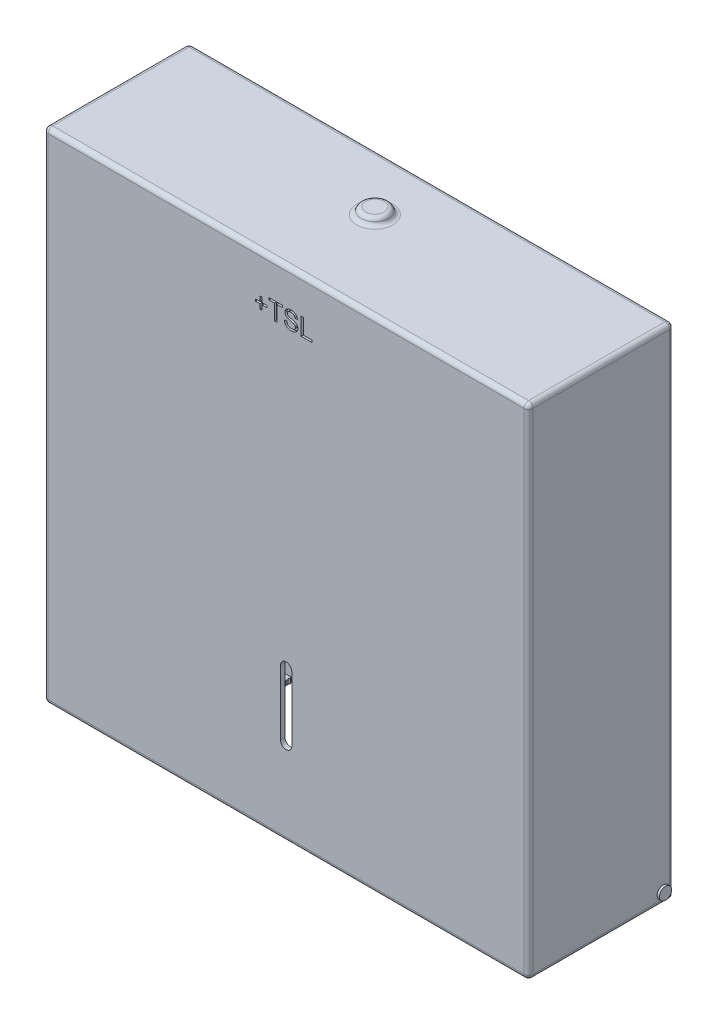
from build123d import *

# Parameters (mm, degrees)
SKETCH2_W              = 271.9832
SKETCH2_H              = 279.9842
BOSS_EXTRUDE1_DEPTH    = 81.56053127
SHELL2_T               = 2.54
FILLET1_R              = 2.54
CUT_EXTRUDE1_DEPTH     = 1.27
CUT_EXTRUDE4_DEPTH     = 13.97
SKETCH6_R              = 7.747
BOSS_EXTRUDE2_DEPTH    = 3.81
FILLET2_R              = 2.54
FILLET3_R              = 2.54
SKETCH7_R              = 3.429
SKETCH7_R_2            = 1.7145
CUT_EXTRUDE6_DEPTH     = 3.81
SKETCH8_W              = 152.6032
SKETCH8_H              = 76.48053127
CUT_EXTRUDE7_DEPTH     = 3.81
SKETCH9_R              = 3.429
BOSS_EXTRUDE3_DEPTH    = 1.27
LPATTERN3_COUNT        = 2
LPATTERN3_PITCH        = 273.05
BOSS_EXTRUDE4_DEPTH    = 2.54
LPATTERN4_COUNT        = 60
LPATTERN4_PITCH        = 1.27
BOSS_EXTRUDE5_DEPTH    = 2.54
LPATTERN5_COUNT        = 60
LPATTERN5_PITCH        = 1.27
CUT_EXTRUDE8_DEPTH     = 2.54
LPATTERN6_COUNT        = 2
LPATTERN6_PITCH        = 199.9996
LPATTERN7_COUNT        = 2
LPATTERN7_PITCH        = 199.9996
LPATTERN7_COPY_1_DEPTH = 2.54


with BuildPart() as part:
    # Sketch2 → Boss-Extrude1 (new body)
    with BuildSketch(Plane.XY):
        Rectangle(SKETCH2_W, SKETCH2_H)
    extrude(amount=-BOSS_EXTRUDE1_DEPTH)

    # Shell2 (no face opened: a closed hollow body)
    add(offset(amount=-SHELL2_T, mode=Mode.PRIVATE), mode=Mode.SUBTRACT)

    # Fillet1
    fillet1_edges = [part.edges().sort_by_distance(p)[0] for p in [
        (-135.9916, 0, -81.56053127),
        (0, -139.9921, -81.56053127),
        (135.9916, 0, -81.56053127),
        (0, -139.9921, 0),
        (-135.9916, 0, 0),
        (0, 139.9921, 0),
        (135.9916, 0, 0),
        (135.9916, -139.9921, -40.780265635),
        (-135.9916, -139.9921, -40.780265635),
        (-135.9916, 139.9921, -40.780265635),
        (135.9916, 139.9921, -40.780265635),
        (0, 139.9921, -81.56053127),
    ]]
    fillet(fillet1_edges, radius=FILLET1_R)

    # Sketch3 → Cut-Extrude1 (cut)
    with BuildSketch(Plane.XY):
        Polygon((-14.547920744, 111.621301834), (-14.547920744, 114.248889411), (-17.175508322, 114.248889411), (-17.175508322, 115.374998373), (-14.547920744, 115.374998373), (-14.547920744, 118.002585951), (-13.421811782, 118.002585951), (-13.421811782, 115.374998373), (-10.794224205, 115.374998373), (-10.794224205, 114.248889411), (-13.421811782, 114.248889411), (-13.421811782, 111.621301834), align=None)
        Polygon((-6.540034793, 109.9947), (-6.540034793, 118.628202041), (-9.668115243, 118.628202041), (-9.668115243, 119.754311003), (-2.035598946, 119.754311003), (-2.035598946, 118.628202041), (-5.163679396, 118.628202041), (-5.163679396, 109.9947), align=None)
        with BuildLine():
            Line((-1.034613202, 113.373026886), (0.341742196, 113.373026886))
            add(Edge.make_bspline(
                [(0.341742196, 113.373026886), (0.356881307, 113.249449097), (0.385964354, 113.012049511), (0.467283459, 112.675571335), (0.571946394, 112.373042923), (0.702353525, 112.100449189), (0.873899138, 111.861058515), (1.080582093, 111.645131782), (1.331587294, 111.458152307), (1.614914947, 111.291752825), (1.930462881, 111.161102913), (2.267338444, 111.064249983), (2.623935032, 111.00686385), (2.868110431, 110.999464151), (2.992790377, 110.995685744)],
                knots=[0, 0, 0, 0, 1.125557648, 2.162256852, 3.1243583, 4.018160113, 4.88511607, 5.777380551, 6.711250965, 7.707237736, 8.743031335, 9.791730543, 10.872421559, 12, 12, 12, 12], degree=3))
            add(Edge.make_bspline(
                [(2.992790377, 110.995685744), (3.103121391, 110.997727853), (3.318245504, 111.001709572), (3.629446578, 111.049539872), (3.922287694, 111.117385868), (4.191318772, 111.220013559), (4.435547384, 111.344635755), (4.647632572, 111.495369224), (4.828699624, 111.66535517), (4.970488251, 111.85907093), (5.081874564, 112.062052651), (5.16358794, 112.270696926), (5.212262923, 112.483845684), (5.218465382, 112.627263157), (5.221547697, 112.698534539)],
                knots=[0, 0, 0, 0, 1.267006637, 2.470417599, 3.611360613, 4.716023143, 5.771382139, 6.754486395, 7.697536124, 8.612899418, 9.501261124, 10.352596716, 11.181322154, 12, 12, 12, 12], degree=3))
            add(Edge.make_bspline(
                [(5.221547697, 112.698534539), (5.218252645, 112.769083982), (5.211812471, 112.906972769), (5.169843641, 113.107721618), (5.090075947, 113.291465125), (4.986568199, 113.465702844), (4.842571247, 113.62500549), (4.66064735, 113.771788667), (4.436788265, 113.904863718), (4.269711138, 113.977743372), (4.181460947, 114.016238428)],
                knots=[0, 0, 0, 0, 0.942140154, 1.841411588, 2.718743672, 3.605002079, 4.535543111, 5.568170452, 6.715506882, 8, 8, 8, 8], degree=3))
            add(Edge.make_bspline(
                [(4.181460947, 114.016238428), (4.147077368, 114.030348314), (4.069398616, 114.062225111), (3.936260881, 114.1044245), (3.778276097, 114.158992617), (3.591648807, 114.215188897), (3.377378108, 114.274636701), (3.135820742, 114.341922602), (2.867111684, 114.413477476), (2.578871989, 114.489639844), (2.287837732, 114.567085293), (2.009788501, 114.644603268), (1.753969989, 114.723293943), (1.518286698, 114.799062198), (1.303953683, 114.875143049), (1.110362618, 114.949453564), (0.937272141, 115.020486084), (0.831555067, 115.072715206), (0.781628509, 115.097381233)],
                knots=[0, 0, 0, 0, 0.499201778, 1.127787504, 1.87543728, 2.745208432, 3.745951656, 4.863402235, 6.114490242, 7.482339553, 8.869366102, 10.161191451, 11.360587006, 12.46547846, 13.487450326, 14.41601931, 15.251940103, 16, 16, 16, 16], degree=3))
            add(Edge.make_bspline(
                [(0.781628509, 115.097381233), (0.666761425, 115.159435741), (0.445038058, 115.279217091), (0.146622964, 115.493386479), (-0.104822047, 115.731047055), (-0.308236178, 115.991854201), (-0.467643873, 116.271397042), (-0.575195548, 116.570150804), (-0.648859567, 116.882692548), (-0.655743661, 117.097613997), (-0.659243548, 117.206880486)],
                knots=[0, 0, 0, 0, 1.158441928, 2.236094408, 3.251151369, 4.220012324, 5.163146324, 6.095083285, 7.031536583, 8, 8, 8, 8], degree=3))
            add(Edge.make_bspline(
                [(-0.659243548, 117.206880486), (-0.654598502, 117.327874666), (-0.645359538, 117.568531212), (-0.563404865, 117.921679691), (-0.432685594, 118.261502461), (-0.283887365, 118.531292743), (-0.13877621, 118.735306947), (-0.01847796, 118.882234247), (0.116460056, 119.018048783), (0.261882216, 119.144646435), (0.420388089, 119.260135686), (0.588045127, 119.369263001), (0.77092158, 119.463060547), (1.027890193, 119.582443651), (1.371652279, 119.701658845), (1.804405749, 119.805539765), (2.259864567, 119.866713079), (2.570315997, 119.875133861), (2.728858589, 119.879434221)],
                knots=[0, 0, 0, 0, 1.199927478, 2.386647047, 3.578628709, 4.806592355, 5.433127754, 6.062729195, 6.689531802, 7.331674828, 7.974827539, 8.635320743, 9.315455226, 10.01318112, 11.447700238, 12.918145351, 14.426146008, 16, 16, 16, 16], degree=3))
            add(Edge.make_bspline(
                [(2.728858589, 119.879434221), (2.902393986, 119.875457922), (3.240300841, 119.867715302), (3.731289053, 119.803298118), (4.189246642, 119.692676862), (4.548392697, 119.568847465), (4.813905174, 119.443487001), (5.002532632, 119.345669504), (5.177616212, 119.232574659), (5.340732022, 119.110188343), (5.493395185, 118.97856645), (5.631681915, 118.834578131), (5.761597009, 118.683136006), (5.914265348, 118.465712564), (6.078874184, 118.177953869), (6.221200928, 117.805151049), (6.318981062, 117.411688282), (6.338001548, 117.139677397), (6.347656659, 117.001600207)],
                knots=[0, 0, 0, 0, 1.607600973, 3.130308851, 4.577334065, 5.967726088, 6.640410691, 7.296826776, 7.935019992, 8.569057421, 9.185393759, 9.8003086, 10.417295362, 11.032210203, 12.259799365, 13.477607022, 14.719591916, 16, 16, 16, 16], degree=3))
            Line((6.347656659, 117.001600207), (4.971301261, 117.001600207))
            add(Edge.make_bspline(
                [(4.971301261, 117.001600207), (4.962556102, 117.07148511), (4.945444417, 117.208229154), (4.902992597, 117.40618673), (4.84348369, 117.590040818), (4.773780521, 117.761505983), (4.689285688, 117.918798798), (4.590789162, 118.063429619), (4.477091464, 118.193694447), (4.351118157, 118.313035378), (4.209035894, 118.416948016), (4.05157474, 118.507147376), (3.878468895, 118.583345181), (3.689870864, 118.645753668), (3.485743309, 118.694142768), (3.26562194, 118.729738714), (3.029591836, 118.747968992), (2.867041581, 118.751508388), (2.783599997, 118.753325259)],
                knots=[0, 0, 0, 0, 1.074487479, 2.102453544, 3.083708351, 4.020042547, 4.923259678, 5.803182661, 6.684453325, 7.556870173, 8.445961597, 9.363679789, 10.320905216, 11.327237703, 12.390948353, 13.519046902, 14.726457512, 16, 16, 16, 16], degree=3))
            add(Edge.make_bspline(
                [(2.783599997, 118.753325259), (2.696866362, 118.752671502), (2.528971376, 118.751405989), (2.286260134, 118.728337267), (2.061298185, 118.696686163), (1.854471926, 118.649998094), (1.666458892, 118.588883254), (1.494468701, 118.518309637), (1.34331468, 118.428874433), (1.209473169, 118.329255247), (1.094017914, 118.219032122), (0.994512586, 118.102883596), (0.90650781, 117.984222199), (0.838126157, 117.856561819), (0.782453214, 117.72473715), (0.746538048, 117.58627032), (0.721109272, 117.443722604), (0.718462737, 117.34645944), (0.71711185, 117.296812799)],
                knots=[0, 0, 0, 0, 1.464176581, 2.834285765, 4.113735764, 5.29917439, 6.409476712, 7.449999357, 8.431575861, 9.367089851, 10.262376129, 11.120706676, 11.948504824, 12.751342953, 13.560717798, 14.359016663, 15.162382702, 16, 16, 16, 16], degree=3))
            add(Edge.make_bspline(
                [(0.71711185, 117.296812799), (0.720668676, 117.212845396), (0.727572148, 117.049872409), (0.79806669, 116.81833692), (0.906487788, 116.60727732), (1.013299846, 116.49244087), (1.06706585, 116.434635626)],
                knots=[0, 0, 0, 0, 1.050964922, 2.039826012, 3.013306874, 4, 4, 4, 4], degree=3))
            add(Edge.make_bspline(
                [(1.06706585, 116.434635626), (1.100959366, 116.40574733), (1.175912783, 116.341862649), (1.31537517, 116.257318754), (1.488287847, 116.171897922), (1.695806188, 116.086983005), (1.93757315, 116.001543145), (2.213198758, 115.913572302), (2.523732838, 115.826200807), (2.859711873, 115.742003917), (3.19912904, 115.657468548), (3.521689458, 115.573255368), (3.817854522, 115.493444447), (4.087154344, 115.415601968), (4.329867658, 115.33994804), (4.545150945, 115.264897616), (4.734745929, 115.195870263), (4.850895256, 115.147303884), (4.904829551, 115.124751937)],
                knots=[0, 0, 0, 0, 0.523891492, 1.158553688, 1.913783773, 2.794766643, 3.797521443, 4.933638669, 6.202080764, 7.596537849, 9.013317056, 10.322179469, 11.523240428, 12.626146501, 13.623953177, 14.517289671, 15.311498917, 16, 16, 16, 16], degree=3))
            add(Edge.make_bspline(
                [(4.904829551, 115.124751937), (4.975000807, 115.092398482), (5.112735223, 115.028894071), (5.307854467, 114.920469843), (5.48992189, 114.807877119), (5.65746651, 114.688084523), (5.809946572, 114.560840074), (5.949066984, 114.427601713), (6.075667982, 114.289118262), (6.184641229, 114.140957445), (6.282488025, 113.989108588), (6.368110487, 113.831449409), (6.437052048, 113.667052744), (6.497518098, 113.497900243), (6.541010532, 113.322110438), (6.575117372, 113.141458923), (6.595011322, 112.955096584), (6.596930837, 112.828917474), (6.597903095, 112.765006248)],
                knots=[0, 0, 0, 0, 1.198900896, 2.353241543, 3.461831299, 4.520043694, 5.547003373, 6.541368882, 7.508191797, 8.454912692, 9.392021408, 10.310662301, 11.235020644, 12.156274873, 13.095836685, 14.042125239, 15.00831306, 16, 16, 16, 16], degree=3))
            add(Edge.make_bspline(
                [(6.597903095, 112.765006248), (6.592809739, 112.637456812), (6.582697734, 112.384228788), (6.495629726, 112.01095897), (6.35885049, 111.649262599), (6.198442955, 111.362236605), (6.046809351, 111.142990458), (5.919429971, 110.985406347), (5.778173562, 110.839695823), (5.626517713, 110.701294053), (5.463284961, 110.573024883), (5.28709915, 110.454844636), (5.09981984, 110.345523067), (4.832389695, 110.212308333), (4.477198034, 110.072953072), (4.024755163, 109.95690273), (3.547935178, 109.881618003), (3.220521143, 109.873645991), (3.053396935, 109.869576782)],
                knots=[0, 0, 0, 0, 1.197055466, 2.376552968, 3.581957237, 4.820753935, 5.454298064, 6.085440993, 6.72202542, 7.359198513, 8.013298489, 8.67051481, 9.351020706, 10.049282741, 11.476266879, 12.925760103, 14.430794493, 16, 16, 16, 16], degree=3))
            add(Edge.make_bspline(
                [(3.053396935, 109.869576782), (2.947135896, 109.870453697), (2.738985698, 109.872171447), (2.433132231, 109.892973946), (2.140027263, 109.923065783), (1.859958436, 109.967887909), (1.593804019, 110.026692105), (1.340608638, 110.09730458), (1.099772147, 110.178629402), (0.872136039, 110.274265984), (0.658294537, 110.385385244), (0.454402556, 110.505254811), (0.263792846, 110.641132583), (0.08606415, 110.790883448), (-0.083286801, 110.950181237), (-0.237240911, 111.125531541), (-0.381032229, 111.311806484), (-0.511375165, 111.510710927), (-0.627816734, 111.719642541), (-0.732530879, 111.935092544), (-0.820754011, 112.158623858), (-0.891853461, 112.38910676), (-0.952078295, 112.624998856), (-0.993842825, 112.868268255), (-1.024549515, 113.118151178), (-1.031238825, 113.287566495), (-1.034613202, 113.373026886)],
                knots=[0, 0, 0, 0, 1.259822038, 2.467811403, 3.633536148, 4.752793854, 5.829021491, 6.863980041, 7.868367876, 8.841470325, 9.788447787, 10.724101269, 11.643985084, 12.560193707, 13.478453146, 14.398077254, 15.323914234, 16.266973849, 17.21495974, 18.158525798, 19.105629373, 20.061269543, 21.017128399, 21.990322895, 22.986232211, 24, 24, 24, 24], degree=3))
        make_face()
        Polygon((8.474751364, 109.9947), (8.474751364, 119.754311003), (9.851106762, 119.754311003), (9.851106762, 111.120808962), (14.480665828, 111.120808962), (14.480665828, 109.9947), align=None)
    extrude(amount=-CUT_EXTRUDE1_DEPTH, mode=Mode.SUBTRACT)

    # Sketch4 → Cut-Extrude4 (cut)
    with BuildSketch(Plane.XY):
        with BuildLine():
            Line((-3.175, -91.997793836), (-3.175, -55.481816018))
            ThreePointArc((-3.175, -55.481816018), (0, -52.4383), (3.175, -55.481816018))
            Line((3.175, -55.481816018), (3.175, -91.997793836))
            ThreePointArc((3.175, -91.997793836), (0, -95.0341), (-3.175, -91.997793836))
        make_face()
    extrude(amount=-CUT_EXTRUDE4_DEPTH, mode=Mode.SUBTRACT)

    # Sketch6 → Boss-Extrude2 (add)
    with BuildSketch(Plane(origin=(0, 139.9921, 0), x_dir=(1, 0, 0), z_dir=(0, 1, 0))):
        with Locations(Location((0, 49.81053127, 0), (0, 0, 90))):
            Circle(SKETCH6_R)
    extrude(amount=BOSS_EXTRUDE2_DEPTH)

    # Fillet2
    fillet2_edges = [part.edges().sort_by_distance(p)[0] for p in [
        (0, 143.8021, -42.06353127),
    ]]
    fillet(fillet2_edges, radius=FILLET2_R)

    # Fillet3
    fillet3_edges = [part.edges().sort_by_distance(p)[0] for p in [
        (0, 139.9921, -42.06353127),
    ]]
    fillet(fillet3_edges, radius=FILLET3_R)

    # Sketch7 → Cut-Extrude6 (cut)
    with BuildSketch(Plane(origin=(0, 0, -81.56053127), x_dir=(-1, 0, 0), z_dir=(0, 0, -1))):
        with Locations((0, -57.4421)):
            Circle(SKETCH7_R)
        with Locations((0, -32.0421)):
            Circle(SKETCH7_R_2)
        with Locations((0, -6.6421)):
            Circle(SKETCH7_R_2)
        with Locations((0, 18.7579)):
            Circle(SKETCH7_R)
    extrude(amount=-CUT_EXTRUDE6_DEPTH, mode=Mode.SUBTRACT)

    # Sketch8 → Cut-Extrude7 (cut)
    with BuildSketch(Plane.XZ.offset(139.9921)):
        with Locations((0, -40.780265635)):
            Rectangle(SKETCH8_W, SKETCH8_H)
    extrude(amount=-CUT_EXTRUDE7_DEPTH, mode=Mode.SUBTRACT)

    # Sketch9 → Boss-Extrude3 (add)
    with BuildSketch(Plane(origin=(135.9916, 0, 0), x_dir=(0, 0, -1), z_dir=(1, 0, 0))):
        with Locations((75.59153127, -134.0231)):
            Circle(SKETCH9_R)
    boss_extrude3 = extrude(amount=BOSS_EXTRUDE3_DEPTH)

    # LPattern3: Boss-Extrude3 ×2
    with Locations(*[(-i * LPATTERN3_PITCH, 0, 0) for i in range(1, LPATTERN3_COUNT)]):
        add(boss_extrude3)

    # Sketch12 → Boss-Extrude4 (add)
    with BuildSketch(Plane.XZ.offset(139.9921)):
        Polygon((-76.3016, -2.54), (-76.3016, -3.74016019), (-75.743411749, -3.140080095), align=None)
    boss_extrude4 = extrude(amount=-BOSS_EXTRUDE4_DEPTH)

    # LPattern4: Boss-Extrude4 ×60
    with Locations(*[(0, 0, -i * LPATTERN4_PITCH) for i in range(1, LPATTERN4_COUNT)]):
        add(boss_extrude4)

    # Sketch13 → Boss-Extrude5 (add)
    with BuildSketch(Plane.XZ.offset(139.9921)):
        Polygon((76.3016, -2.54), (76.3016, -3.751726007), (75.866001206, -3.145863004), align=None)
    boss_extrude5 = extrude(amount=-BOSS_EXTRUDE5_DEPTH)

    # LPattern5: Boss-Extrude5 ×60
    with Locations(*[(0, 0, -i * LPATTERN5_PITCH) for i in range(1, LPATTERN5_COUNT)]):
        add(boss_extrude5)

    # Sketch14 → Cut-Extrude8 (cut)
    with BuildSketch(Plane(origin=(0, 0, -81.56053127), x_dir=(-1, 0, 0), z_dir=(0, 0, -1))):
        with BuildLine():
            Line((-103.2256, -105.028838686), (-103.2256, -98.982390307))
            ThreePointArc((-103.2256, -98.982390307), (-100.0506, -95.807390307), (-96.8756, -98.982390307))
            Line((-96.8756, -98.982390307), (-96.8756, -105.028838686))
            ThreePointArc((-96.8756, -105.028838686), (-100.0506, -116.8781), (-103.2256, -105.028838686))
        make_face()
    cut_extrude8 = extrude(amount=-CUT_EXTRUDE8_DEPTH, mode=Mode.SUBTRACT)

    # LPattern6: Cut-Extrude8 ×2
    with Locations(*[(-i * LPATTERN6_PITCH, 0, 0) for i in range(1, LPATTERN6_COUNT)]):
        add(cut_extrude8, mode=Mode.SUBTRACT)

    # LPattern7: Cut-Extrude8 ×2
    with Locations(*[(0, i * LPATTERN7_PITCH, 0) for i in range(1, LPATTERN7_COUNT)]):
        add(cut_extrude8, mode=Mode.SUBTRACT)

    # LPattern7 copy 1 sketch → LPattern7 copy 1 (cut)
    with BuildSketch(Plane(origin=(-199.9996, 199.9996, -81.56053127), x_dir=(-1, 0, 0), z_dir=(0, 0, -1))):
        with BuildLine():
            Line((-103.2256, -105.028838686), (-103.2256, -98.982390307))
            ThreePointArc((-103.2256, -98.982390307), (-100.0506, -95.807390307), (-96.8756, -98.982390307))
            Line((-96.8756, -98.982390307), (-96.8756, -105.028838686))
            ThreePointArc((-96.8756, -105.028838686), (-100.0506, -116.8781), (-103.2256, -105.028838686))
        make_face()
    extrude(amount=-LPATTERN7_COPY_1_DEPTH, mode=Mode.SUBTRACT)


solid = part.part
